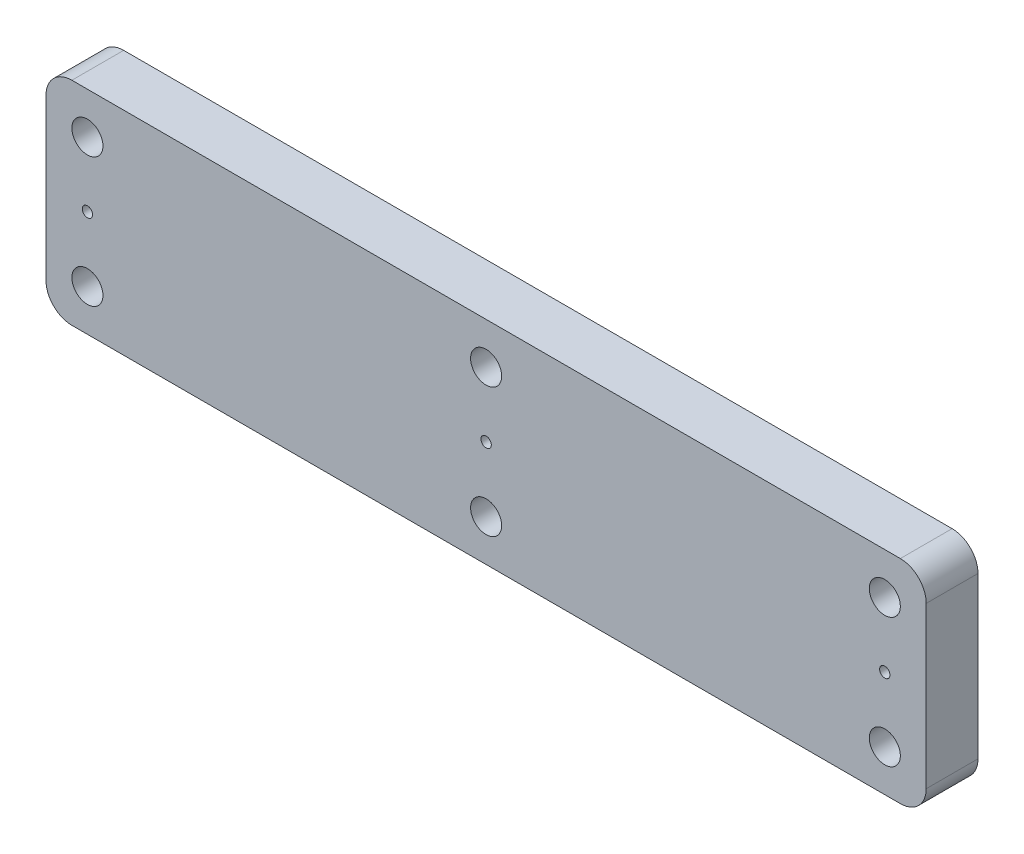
from build123d import *

# Parameters (mm, degrees)
ESQUISSE1_R             = 3
EXTRUSION1_DEPTH        = 10
ESQUISSE3_R             = 1
ENL_V_MAT_EXTRU_1_DEPTH = 2


with BuildPart() as part:
    # Esquisse1 → Extrusion1 (new body)
    with BuildSketch(Plane.XY):
        with BuildLine():
            Line((5, 0), (165, 0))
            ThreePointArc((165, 0), (168.535533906, 1.464466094), (170, 5))
            Line((170, 5), (170, 36))
            ThreePointArc((170, 36), (168.535533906, 39.535533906), (165, 41))
            Line((165, 41), (5, 41))
            ThreePointArc((5, 41), (1.464466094, 39.535533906), (0, 36))
            Line((0, 36), (0, 5))
            ThreePointArc((0, 5), (1.464466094, 1.464466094), (5, 0))
        make_face()
        with Locations((8, 33)):
            Circle(ESQUISSE1_R, mode=Mode.SUBTRACT)
        with Locations((162, 33)):
            Circle(ESQUISSE1_R, mode=Mode.SUBTRACT)
        with Locations((162, 8)):
            Circle(ESQUISSE1_R, mode=Mode.SUBTRACT)
        with Locations((85, 33)):
            Circle(ESQUISSE1_R, mode=Mode.SUBTRACT)
        with Locations((85, 8)):
            Circle(ESQUISSE1_R, mode=Mode.SUBTRACT)
        with Locations((8, 8)):
            Circle(ESQUISSE1_R, mode=Mode.SUBTRACT)
    extrude(amount=EXTRUSION1_DEPTH)

    # Esquisse3 → Enl_v. mat.-Extru.1 (cut)
    with BuildSketch(Plane.XY.offset(10)):
        with Locations((8, 20.5)):
            Circle(ESQUISSE3_R)
        with Locations((85, 20.5)):
            Circle(ESQUISSE3_R)
        with Locations((162, 20.5)):
            Circle(ESQUISSE3_R)
    extrude(amount=-ENL_V_MAT_EXTRU_1_DEPTH, mode=Mode.SUBTRACT)


solid = part.part
